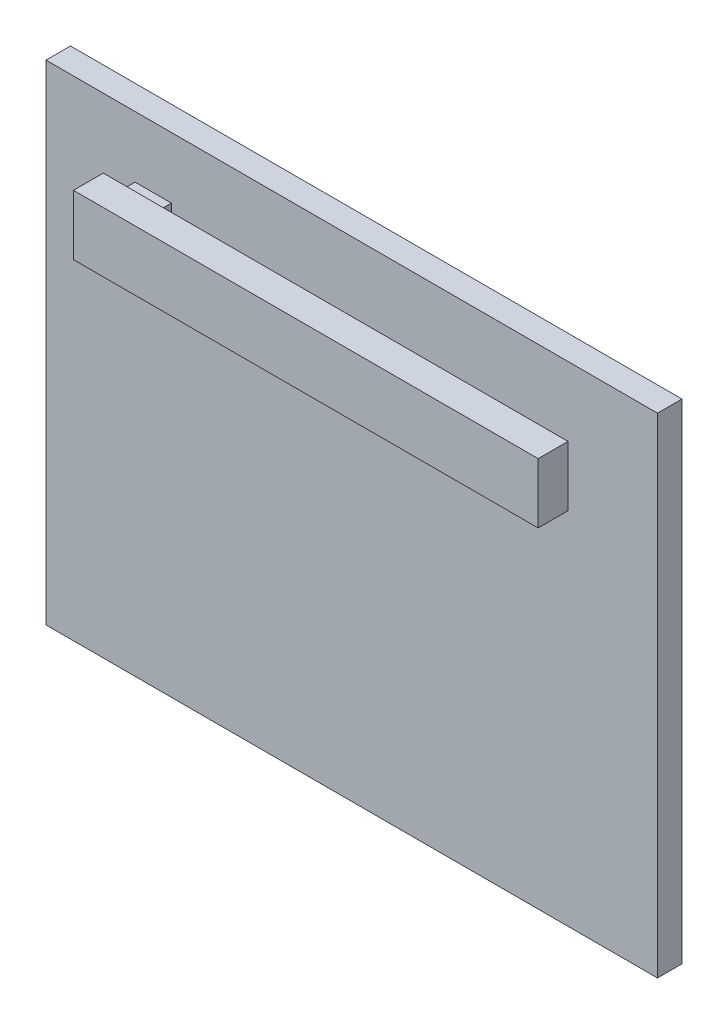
ISO-10303-21;
HEADER;
FILE_DESCRIPTION(('STEP AP214'),'2;1');
FILE_NAME('part.step','',(''),(''),'','','');
FILE_SCHEMA(('AUTOMOTIVE_DESIGN { 1 0 10303 214 1 1 1 1 }'));
ENDSEC;
DATA;
#1=APPLICATION_CONTEXT('core data for automotive mechanical design processes');
#2=APPLICATION_PROTOCOL_DEFINITION('international standard','automotive_design',2000,#1);
#3=PRODUCT_CONTEXT('',#1,'mechanical');
#4=PRODUCT('Part','Part','',(#3));
#5=PRODUCT_RELATED_PRODUCT_CATEGORY('part','',(#4));
#6=PRODUCT_DEFINITION_FORMATION('','',#4);
#7=PRODUCT_DEFINITION_CONTEXT('part definition',#1,'design');
#8=PRODUCT_DEFINITION('design','',#6,#7);
#9=PRODUCT_DEFINITION_SHAPE('','',#8);
#10=(LENGTH_UNIT() NAMED_UNIT(*) SI_UNIT(.MILLI.,.METRE.));
#11=(NAMED_UNIT(*) PLANE_ANGLE_UNIT() SI_UNIT($,.RADIAN.));
#12=(NAMED_UNIT(*) SI_UNIT($,.STERADIAN.) SOLID_ANGLE_UNIT());
#13=UNCERTAINTY_MEASURE_WITH_UNIT(LENGTH_MEASURE(1.E-05),#10,'distance_accuracy_value','');
#14=(GEOMETRIC_REPRESENTATION_CONTEXT(3) GLOBAL_UNCERTAINTY_ASSIGNED_CONTEXT((#13)) GLOBAL_UNIT_ASSIGNED_CONTEXT((#10,
#11,#12)) REPRESENTATION_CONTEXT('',''));
#15=CARTESIAN_POINT('',(0.,0.,0.));
#16=DIRECTION('',(0.,0.,1.));
#17=DIRECTION('',(1.,0.,0.));
#18=AXIS2_PLACEMENT_3D('',#15,#16,#17);
#19=CARTESIAN_POINT('',(0.,0.,2.));
#20=DIRECTION('',(0.,0.,1.));
#21=DIRECTION('',(1.,0.,0.));
#22=AXIS2_PLACEMENT_3D('',#19,#20,#21);
#23=PLANE('',#22);
#24=DIRECTION('',(0.,1.,0.));
#25=VECTOR('',#24,1.);
#26=CARTESIAN_POINT('',(25.,20.,2.));
#27=LINE('',#26,#25);
#28=CARTESIAN_POINT('',(25.,-20.,2.));
#29=VERTEX_POINT('',#28);
#30=CARTESIAN_POINT('',(25.,20.,2.));
#31=VERTEX_POINT('',#30);
#32=EDGE_CURVE('E203',#29,#31,#27,.T.);
#33=ORIENTED_EDGE('',*,*,#32,.T.);
#34=DIRECTION('',(-1.,0.,0.));
#35=VECTOR('',#34,1.);
#36=CARTESIAN_POINT('',(-25.,20.,2.));
#37=LINE('',#36,#35);
#38=CARTESIAN_POINT('',(-25.,20.,2.));
#39=VERTEX_POINT('',#38);
#40=EDGE_CURVE('E207',#31,#39,#37,.T.);
#41=ORIENTED_EDGE('',*,*,#40,.T.);
#42=DIRECTION('',(0.,-1.,0.));
#43=VECTOR('',#42,1.);
#44=CARTESIAN_POINT('',(-25.,20.,2.));
#45=LINE('',#44,#43);
#46=CARTESIAN_POINT('',(-25.,-20.,2.));
#47=VERTEX_POINT('',#46);
#48=EDGE_CURVE('E211',#39,#47,#45,.T.);
#49=ORIENTED_EDGE('',*,*,#48,.T.);
#50=DIRECTION('',(1.,0.,0.));
#51=VECTOR('',#50,1.);
#52=CARTESIAN_POINT('',(-25.,-20.,2.));
#53=LINE('',#52,#51);
#54=EDGE_CURVE('E214',#47,#29,#53,.T.);
#55=ORIENTED_EDGE('',*,*,#54,.T.);
#56=EDGE_LOOP('',(#33,#41,#49,#55));
#57=FACE_BOUND('',#56,.T.);
#58=DIRECTION('',(1.,0.,0.));
#59=VECTOR('',#58,1.);
#60=CARTESIAN_POINT('',(-17.7182207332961,12.0314268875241,2.));
#61=LINE('',#60,#59);
#62=CARTESIAN_POINT('',(-17.7182207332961,12.0314268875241,2.));
#63=VERTEX_POINT('',#62);
#64=CARTESIAN_POINT('',(-14.7482207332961,12.0314268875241,2.));
#65=VERTEX_POINT('',#64);
#66=EDGE_CURVE('E182',#63,#65,#61,.T.);
#67=ORIENTED_EDGE('',*,*,#66,.F.);
#68=DIRECTION('',(0.,-1.,0.));
#69=VECTOR('',#68,1.);
#70=CARTESIAN_POINT('',(-17.7182207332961,15.0014268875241,2.));
#71=LINE('',#70,#69);
#72=CARTESIAN_POINT('',(-17.7182207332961,15.0014268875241,2.));
#73=VERTEX_POINT('',#72);
#74=EDGE_CURVE('E155',#73,#63,#71,.T.);
#75=ORIENTED_EDGE('',*,*,#74,.F.);
#76=DIRECTION('',(-1.,0.,0.));
#77=VECTOR('',#76,1.);
#78=CARTESIAN_POINT('',(-17.7182207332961,15.0014268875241,2.));
#79=LINE('',#78,#77);
#80=CARTESIAN_POINT('',(-14.7482207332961,15.0014268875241,2.));
#81=VERTEX_POINT('',#80);
#82=EDGE_CURVE('E170',#81,#73,#79,.T.);
#83=ORIENTED_EDGE('',*,*,#82,.F.);
#84=DIRECTION('',(0.,1.,0.));
#85=VECTOR('',#84,1.);
#86=CARTESIAN_POINT('',(-14.7482207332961,15.0014268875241,2.));
#87=LINE('',#86,#85);
#88=EDGE_CURVE('E185',#65,#81,#87,.T.);
#89=ORIENTED_EDGE('',*,*,#88,.F.);
#90=EDGE_LOOP('',(#67,#75,#83,#89));
#91=FACE_BOUND('',#90,.T.);
#92=ADVANCED_FACE('F39',(#57,#91),#23,.T.);
#93=CARTESIAN_POINT('',(25.,20.,2.));
#94=DIRECTION('',(-1.,0.,0.));
#95=DIRECTION('',(0.,-1.,0.));
#96=AXIS2_PLACEMENT_3D('',#93,#94,#95);
#97=PLANE('',#96);
#98=DIRECTION('',(0.,1.,0.));
#99=VECTOR('',#98,1.);
#100=CARTESIAN_POINT('',(25.,20.,0.));
#101=LINE('',#100,#99);
#102=CARTESIAN_POINT('',(25.,-20.,0.));
#103=VERTEX_POINT('',#102);
#104=CARTESIAN_POINT('',(25.,20.,0.));
#105=VERTEX_POINT('',#104);
#106=EDGE_CURVE('E202',#103,#105,#101,.T.);
#107=ORIENTED_EDGE('',*,*,#106,.T.);
#108=DIRECTION('',(0.,0.,-1.));
#109=VECTOR('',#108,1.);
#110=CARTESIAN_POINT('',(25.,20.,2.));
#111=LINE('',#110,#109);
#112=EDGE_CURVE('E11',#31,#105,#111,.T.);
#113=ORIENTED_EDGE('',*,*,#112,.F.);
#114=ORIENTED_EDGE('',*,*,#32,.F.);
#115=DIRECTION('',(0.,0.,-1.));
#116=VECTOR('',#115,1.);
#117=CARTESIAN_POINT('',(25.,-20.,2.));
#118=LINE('',#117,#116);
#119=EDGE_CURVE('E217',#29,#103,#118,.T.);
#120=ORIENTED_EDGE('',*,*,#119,.T.);
#121=EDGE_LOOP('',(#107,#113,#114,#120));
#122=FACE_BOUND('',#121,.T.);
#123=ADVANCED_FACE('F41',(#122),#97,.F.);
#124=CARTESIAN_POINT('',(-25.,20.,2.));
#125=DIRECTION('',(0.,-1.,0.));
#126=DIRECTION('',(0.,0.,-1.));
#127=AXIS2_PLACEMENT_3D('',#124,#125,#126);
#128=PLANE('',#127);
#129=DIRECTION('',(-1.,0.,0.));
#130=VECTOR('',#129,1.);
#131=CARTESIAN_POINT('',(-25.,20.,0.));
#132=LINE('',#131,#130);
#133=CARTESIAN_POINT('',(-25.,20.,0.));
#134=VERTEX_POINT('',#133);
#135=EDGE_CURVE('E221',#105,#134,#132,.T.);
#136=ORIENTED_EDGE('',*,*,#135,.T.);
#137=DIRECTION('',(0.,0.,-1.));
#138=VECTOR('',#137,1.);
#139=CARTESIAN_POINT('',(-25.,20.,2.));
#140=LINE('',#139,#138);
#141=EDGE_CURVE('E48',#39,#134,#140,.T.);
#142=ORIENTED_EDGE('',*,*,#141,.F.);
#143=ORIENTED_EDGE('',*,*,#40,.F.);
#144=ORIENTED_EDGE('',*,*,#112,.T.);
#145=EDGE_LOOP('',(#136,#142,#143,#144));
#146=FACE_BOUND('',#145,.T.);
#147=ADVANCED_FACE('F257',(#146),#128,.F.);
#148=CARTESIAN_POINT('',(-25.,20.,2.));
#149=DIRECTION('',(1.,0.,0.));
#150=DIRECTION('',(0.,1.,0.));
#151=AXIS2_PLACEMENT_3D('',#148,#149,#150);
#152=PLANE('',#151);
#153=DIRECTION('',(0.,-1.,0.));
#154=VECTOR('',#153,1.);
#155=CARTESIAN_POINT('',(-25.,20.,0.));
#156=LINE('',#155,#154);
#157=CARTESIAN_POINT('',(-25.,-20.,0.));
#158=VERTEX_POINT('',#157);
#159=EDGE_CURVE('E224',#134,#158,#156,.T.);
#160=ORIENTED_EDGE('',*,*,#159,.T.);
#161=DIRECTION('',(0.,0.,-1.));
#162=VECTOR('',#161,1.);
#163=CARTESIAN_POINT('',(-25.,-20.,2.));
#164=LINE('',#163,#162);
#165=EDGE_CURVE('E232',#47,#158,#164,.T.);
#166=ORIENTED_EDGE('',*,*,#165,.F.);
#167=ORIENTED_EDGE('',*,*,#48,.F.);
#168=ORIENTED_EDGE('',*,*,#141,.T.);
#169=EDGE_LOOP('',(#160,#166,#167,#168));
#170=FACE_BOUND('',#169,.T.);
#171=ADVANCED_FACE('F241',(#170),#152,.F.);
#172=CARTESIAN_POINT('',(-25.,-20.,2.));
#173=DIRECTION('',(0.,1.,0.));
#174=DIRECTION('',(0.,0.,1.));
#175=AXIS2_PLACEMENT_3D('',#172,#173,#174);
#176=PLANE('',#175);
#177=DIRECTION('',(1.,0.,0.));
#178=VECTOR('',#177,1.);
#179=CARTESIAN_POINT('',(-25.,-20.,0.));
#180=LINE('',#179,#178);
#181=EDGE_CURVE('E208',#158,#103,#180,.T.);
#182=ORIENTED_EDGE('',*,*,#181,.T.);
#183=ORIENTED_EDGE('',*,*,#119,.F.);
#184=ORIENTED_EDGE('',*,*,#54,.F.);
#185=ORIENTED_EDGE('',*,*,#165,.T.);
#186=EDGE_LOOP('',(#182,#183,#184,#185));
#187=FACE_BOUND('',#186,.T.);
#188=ADVANCED_FACE('F250',(#187),#176,.F.);
#189=CARTESIAN_POINT('',(0.,0.,0.));
#190=DIRECTION('',(0.,0.,1.));
#191=DIRECTION('',(1.,0.,0.));
#192=AXIS2_PLACEMENT_3D('',#189,#190,#191);
#193=PLANE('',#192);
#194=ORIENTED_EDGE('',*,*,#106,.F.);
#195=ORIENTED_EDGE('',*,*,#181,.F.);
#196=ORIENTED_EDGE('',*,*,#159,.F.);
#197=ORIENTED_EDGE('',*,*,#135,.F.);
#198=EDGE_LOOP('',(#194,#195,#196,#197));
#199=FACE_BOUND('',#198,.T.);
#200=ADVANCED_FACE('F247',(#199),#193,.F.);
#201=CARTESIAN_POINT('',(-17.7182207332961,15.0014268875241,4.6));
#202=DIRECTION('',(1.,0.,0.));
#203=DIRECTION('',(0.,0.,-1.));
#204=AXIS2_PLACEMENT_3D('',#201,#202,#203);
#205=PLANE('',#204);
#206=ORIENTED_EDGE('',*,*,#74,.T.);
#207=DIRECTION('',(0.,0.,-1.));
#208=VECTOR('',#207,1.);
#209=CARTESIAN_POINT('',(-17.7182207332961,12.0314268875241,4.6));
#210=LINE('',#209,#208);
#211=CARTESIAN_POINT('',(-17.7182207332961,12.0314268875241,4.6));
#212=VERTEX_POINT('',#211);
#213=EDGE_CURVE('E199',#212,#63,#210,.T.);
#214=ORIENTED_EDGE('',*,*,#213,.F.);
#215=DIRECTION('',(0.,-1.,0.));
#216=VECTOR('',#215,1.);
#217=CARTESIAN_POINT('',(-17.7182207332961,15.0014268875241,4.6));
#218=LINE('',#217,#216);
#219=CARTESIAN_POINT('',(-17.7182207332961,15.0014268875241,4.6));
#220=VERTEX_POINT('',#219);
#221=EDGE_CURVE('E165',#220,#212,#218,.T.);
#222=ORIENTED_EDGE('',*,*,#221,.F.);
#223=DIRECTION('',(0.,0.,-1.));
#224=VECTOR('',#223,1.);
#225=CARTESIAN_POINT('',(-17.7182207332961,15.0014268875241,4.6));
#226=LINE('',#225,#224);
#227=EDGE_CURVE('E178',#220,#73,#226,.T.);
#228=ORIENTED_EDGE('',*,*,#227,.T.);
#229=EDGE_LOOP('',(#206,#214,#222,#228));
#230=FACE_BOUND('',#229,.T.);
#231=ADVANCED_FACE('F270',(#230),#205,.F.);
#232=CARTESIAN_POINT('',(-17.7182207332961,12.0314268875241,4.6));
#233=DIRECTION('',(0.,1.,0.));
#234=DIRECTION('',(0.,0.,1.));
#235=AXIS2_PLACEMENT_3D('',#232,#233,#234);
#236=PLANE('',#235);
#237=DIRECTION('',(-1.,0.,0.));
#238=VECTOR('',#237,1.);
#239=CARTESIAN_POINT('',(20.2817792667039,12.0314268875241,7.04));
#240=LINE('',#239,#238);
#241=CARTESIAN_POINT('',(20.2817792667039,12.0314268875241,7.04));
#242=VERTEX_POINT('',#241);
#243=CARTESIAN_POINT('',(-17.719373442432,12.0314268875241,7.04));
#244=VERTEX_POINT('',#243);
#245=EDGE_CURVE('E151',#242,#244,#240,.T.);
#246=ORIENTED_EDGE('',*,*,#245,.T.);
#247=DIRECTION('',(0.,0.,-1.));
#248=VECTOR('',#247,1.);
#249=CARTESIAN_POINT('',(-17.719373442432,12.0314268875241,4.6));
#250=LINE('',#249,#248);
#251=CARTESIAN_POINT('',(-17.719373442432,12.0314268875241,4.6));
#252=VERTEX_POINT('',#251);
#253=EDGE_CURVE('E55',#244,#252,#250,.T.);
#254=ORIENTED_EDGE('',*,*,#253,.T.);
#255=DIRECTION('',(-1.,0.,0.));
#256=VECTOR('',#255,1.);
#257=CARTESIAN_POINT('',(20.2817792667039,12.0314268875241,4.6));
#258=LINE('',#257,#256);
#259=EDGE_CURVE('E164',#212,#252,#258,.T.);
#260=ORIENTED_EDGE('',*,*,#259,.F.);
#261=ORIENTED_EDGE('',*,*,#213,.T.);
#262=ORIENTED_EDGE('',*,*,#66,.T.);
#263=DIRECTION('',(0.,0.,-1.));
#264=VECTOR('',#263,1.);
#265=CARTESIAN_POINT('',(-14.7482207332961,12.0314268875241,4.6));
#266=LINE('',#265,#264);
#267=CARTESIAN_POINT('',(-14.7482207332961,12.0314268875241,4.6));
#268=VERTEX_POINT('',#267);
#269=EDGE_CURVE('E195',#268,#65,#266,.T.);
#270=ORIENTED_EDGE('',*,*,#269,.F.);
#271=CARTESIAN_POINT('',(20.2817792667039,12.0314268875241,4.6));
#272=VERTEX_POINT('',#271);
#273=EDGE_CURVE('E157',#272,#268,#258,.T.);
#274=ORIENTED_EDGE('',*,*,#273,.F.);
#275=DIRECTION('',(0.,0.,1.));
#276=VECTOR('',#275,1.);
#277=CARTESIAN_POINT('',(20.2817792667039,12.0314268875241,4.6));
#278=LINE('',#277,#276);
#279=EDGE_CURVE('E396',#272,#242,#278,.T.);
#280=ORIENTED_EDGE('',*,*,#279,.T.);
#281=EDGE_LOOP('',(#246,#254,#260,#261,#262,#270,#274,#280));
#282=FACE_BOUND('',#281,.T.);
#283=ADVANCED_FACE('F289',(#282),#236,.F.);
#284=CARTESIAN_POINT('',(-14.7482207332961,15.0014268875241,4.6));
#285=DIRECTION('',(-1.,0.,0.));
#286=DIRECTION('',(0.,-1.,0.));
#287=AXIS2_PLACEMENT_3D('',#284,#285,#286);
#288=PLANE('',#287);
#289=ORIENTED_EDGE('',*,*,#88,.T.);
#290=DIRECTION('',(0.,0.,-1.));
#291=VECTOR('',#290,1.);
#292=CARTESIAN_POINT('',(-14.7482207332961,15.0014268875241,4.6));
#293=LINE('',#292,#291);
#294=CARTESIAN_POINT('',(-14.7482207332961,15.0014268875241,4.6));
#295=VERTEX_POINT('',#294);
#296=EDGE_CURVE('E63',#295,#81,#293,.T.);
#297=ORIENTED_EDGE('',*,*,#296,.F.);
#298=DIRECTION('',(0.,1.,0.));
#299=VECTOR('',#298,1.);
#300=CARTESIAN_POINT('',(-14.7482207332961,15.0014268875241,4.6));
#301=LINE('',#300,#299);
#302=EDGE_CURVE('E169',#268,#295,#301,.T.);
#303=ORIENTED_EDGE('',*,*,#302,.F.);
#304=ORIENTED_EDGE('',*,*,#269,.T.);
#305=EDGE_LOOP('',(#289,#297,#303,#304));
#306=FACE_BOUND('',#305,.T.);
#307=ADVANCED_FACE('F297',(#306),#288,.F.);
#308=CARTESIAN_POINT('',(-17.7182207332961,15.0014268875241,4.6));
#309=DIRECTION('',(0.,-1.,0.));
#310=DIRECTION('',(0.,0.,-1.));
#311=AXIS2_PLACEMENT_3D('',#308,#309,#310);
#312=PLANE('',#311);
#313=ORIENTED_EDGE('',*,*,#82,.T.);
#314=ORIENTED_EDGE('',*,*,#227,.F.);
#315=DIRECTION('',(-1.,0.,0.));
#316=VECTOR('',#315,1.);
#317=CARTESIAN_POINT('',(-17.7182207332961,15.0014268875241,4.6));
#318=LINE('',#317,#316);
#319=EDGE_CURVE('E174',#295,#220,#318,.T.);
#320=ORIENTED_EDGE('',*,*,#319,.F.);
#321=ORIENTED_EDGE('',*,*,#296,.T.);
#322=EDGE_LOOP('',(#313,#314,#320,#321));
#323=FACE_BOUND('',#322,.T.);
#324=ADVANCED_FACE('F305',(#323),#312,.F.);
#325=CARTESIAN_POINT('',(20.2817792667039,16.941426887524,4.6));
#326=DIRECTION('',(0.,0.,-1.));
#327=DIRECTION('',(-1.,0.,0.));
#328=AXIS2_PLACEMENT_3D('',#325,#326,#327);
#329=PLANE('',#328);
#330=DIRECTION('',(0.,1.,0.));
#331=VECTOR('',#330,1.);
#332=CARTESIAN_POINT('',(-17.719373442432,6.94142688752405,4.6));
#333=LINE('',#332,#331);
#334=CARTESIAN_POINT('',(-17.719373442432,16.941426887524,4.6));
#335=VERTEX_POINT('',#334);
#336=EDGE_CURVE('E135',#252,#335,#333,.T.);
#337=ORIENTED_EDGE('',*,*,#336,.T.);
#338=DIRECTION('',(-1.,0.,0.));
#339=VECTOR('',#338,1.);
#340=CARTESIAN_POINT('',(20.2817792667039,16.941426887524,4.6));
#341=LINE('',#340,#339);
#342=CARTESIAN_POINT('',(20.2817792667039,16.941426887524,4.6));
#343=VERTEX_POINT('',#342);
#344=EDGE_CURVE('E143',#343,#335,#341,.T.);
#345=ORIENTED_EDGE('',*,*,#344,.F.);
#346=DIRECTION('',(0.,-1.,0.));
#347=VECTOR('',#346,1.);
#348=CARTESIAN_POINT('',(20.2817792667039,16.941426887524,4.6));
#349=LINE('',#348,#347);
#350=EDGE_CURVE('E393',#343,#272,#349,.T.);
#351=ORIENTED_EDGE('',*,*,#350,.T.);
#352=ORIENTED_EDGE('',*,*,#273,.T.);
#353=ORIENTED_EDGE('',*,*,#302,.T.);
#354=ORIENTED_EDGE('',*,*,#319,.T.);
#355=ORIENTED_EDGE('',*,*,#221,.T.);
#356=ORIENTED_EDGE('',*,*,#259,.T.);
#357=EDGE_LOOP('',(#337,#345,#351,#352,#353,#354,#355,#356));
#358=FACE_BOUND('',#357,.T.);
#359=ADVANCED_FACE('F313',(#358),#329,.T.);
#360=CARTESIAN_POINT('',(20.2817792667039,16.941426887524,4.6));
#361=DIRECTION('',(0.,1.,0.));
#362=DIRECTION('',(0.,0.,1.));
#363=AXIS2_PLACEMENT_3D('',#360,#361,#362);
#364=PLANE('',#363);
#365=DIRECTION('',(0.,0.,-1.));
#366=VECTOR('',#365,1.);
#367=CARTESIAN_POINT('',(-17.719373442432,16.941426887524,4.6));
#368=LINE('',#367,#366);
#369=CARTESIAN_POINT('',(-17.719373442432,16.941426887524,7.04));
#370=VERTEX_POINT('',#369);
#371=EDGE_CURVE('E129',#370,#335,#368,.T.);
#372=ORIENTED_EDGE('',*,*,#371,.F.);
#373=DIRECTION('',(-1.,0.,0.));
#374=VECTOR('',#373,1.);
#375=CARTESIAN_POINT('',(20.2817792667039,16.941426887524,7.04));
#376=LINE('',#375,#374);
#377=CARTESIAN_POINT('',(20.2817792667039,16.941426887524,7.04));
#378=VERTEX_POINT('',#377);
#379=EDGE_CURVE('E141',#378,#370,#376,.T.);
#380=ORIENTED_EDGE('',*,*,#379,.F.);
#381=DIRECTION('',(0.,0.,-1.));
#382=VECTOR('',#381,1.);
#383=CARTESIAN_POINT('',(20.2817792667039,16.941426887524,4.6));
#384=LINE('',#383,#382);
#385=EDGE_CURVE('E394',#378,#343,#384,.T.);
#386=ORIENTED_EDGE('',*,*,#385,.T.);
#387=ORIENTED_EDGE('',*,*,#344,.T.);
#388=EDGE_LOOP('',(#372,#380,#386,#387));
#389=FACE_BOUND('',#388,.T.);
#390=ADVANCED_FACE('F139',(#389),#364,.T.);
#391=CARTESIAN_POINT('',(20.2817792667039,12.0314268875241,7.04));
#392=DIRECTION('',(0.,0.,1.));
#393=DIRECTION('',(1.,0.,0.));
#394=AXIS2_PLACEMENT_3D('',#391,#392,#393);
#395=PLANE('',#394);
#396=DIRECTION('',(0.,1.,0.));
#397=VECTOR('',#396,1.);
#398=CARTESIAN_POINT('',(-17.719373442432,6.94142688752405,7.04));
#399=LINE('',#398,#397);
#400=EDGE_CURVE('E126',#244,#370,#399,.T.);
#401=ORIENTED_EDGE('',*,*,#400,.F.);
#402=ORIENTED_EDGE('',*,*,#245,.F.);
#403=DIRECTION('',(0.,1.,0.));
#404=VECTOR('',#403,1.);
#405=CARTESIAN_POINT('',(20.2817792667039,12.0314268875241,7.04));
#406=LINE('',#405,#404);
#407=EDGE_CURVE('E148',#242,#378,#406,.T.);
#408=ORIENTED_EDGE('',*,*,#407,.T.);
#409=ORIENTED_EDGE('',*,*,#379,.T.);
#410=EDGE_LOOP('',(#401,#402,#408,#409));
#411=FACE_BOUND('',#410,.T.);
#412=ADVANCED_FACE('F146',(#411),#395,.T.);
#413=CARTESIAN_POINT('',(20.2817792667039,0.,0.));
#414=DIRECTION('',(-1.,0.,0.));
#415=DIRECTION('',(0.,0.,1.));
#416=AXIS2_PLACEMENT_3D('',#413,#414,#415);
#417=PLANE('',#416);
#418=ORIENTED_EDGE('',*,*,#350,.F.);
#419=ORIENTED_EDGE('',*,*,#385,.F.);
#420=ORIENTED_EDGE('',*,*,#407,.F.);
#421=ORIENTED_EDGE('',*,*,#279,.F.);
#422=EDGE_LOOP('',(#418,#419,#420,#421));
#423=FACE_BOUND('',#422,.T.);
#424=ADVANCED_FACE('F332',(#423),#417,.F.);
#425=CARTESIAN_POINT('',(-17.719373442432,6.94142688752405,4.6));
#426=DIRECTION('',(1.,0.,0.));
#427=DIRECTION('',(0.,0.,-1.));
#428=AXIS2_PLACEMENT_3D('',#425,#426,#427);
#429=PLANE('',#428);
#430=ORIENTED_EDGE('',*,*,#400,.T.);
#431=ORIENTED_EDGE('',*,*,#371,.T.);
#432=ORIENTED_EDGE('',*,*,#336,.F.);
#433=ORIENTED_EDGE('',*,*,#253,.F.);
#434=EDGE_LOOP('',(#430,#431,#432,#433));
#435=FACE_BOUND('',#434,.T.);
#436=ADVANCED_FACE('F128',(#435),#429,.F.);
#437=CLOSED_SHELL('',(#92,#123,#147,#171,#188,#200,#231,#283,#307,#324,#359,#390,#412,#424,#436));
#438=MANIFOLD_SOLID_BREP('B2',#437);
#439=ADVANCED_BREP_SHAPE_REPRESENTATION('',(#18,#438),#14);
#440=SHAPE_DEFINITION_REPRESENTATION(#9,#439);
ENDSEC;
END-ISO-10303-21;
